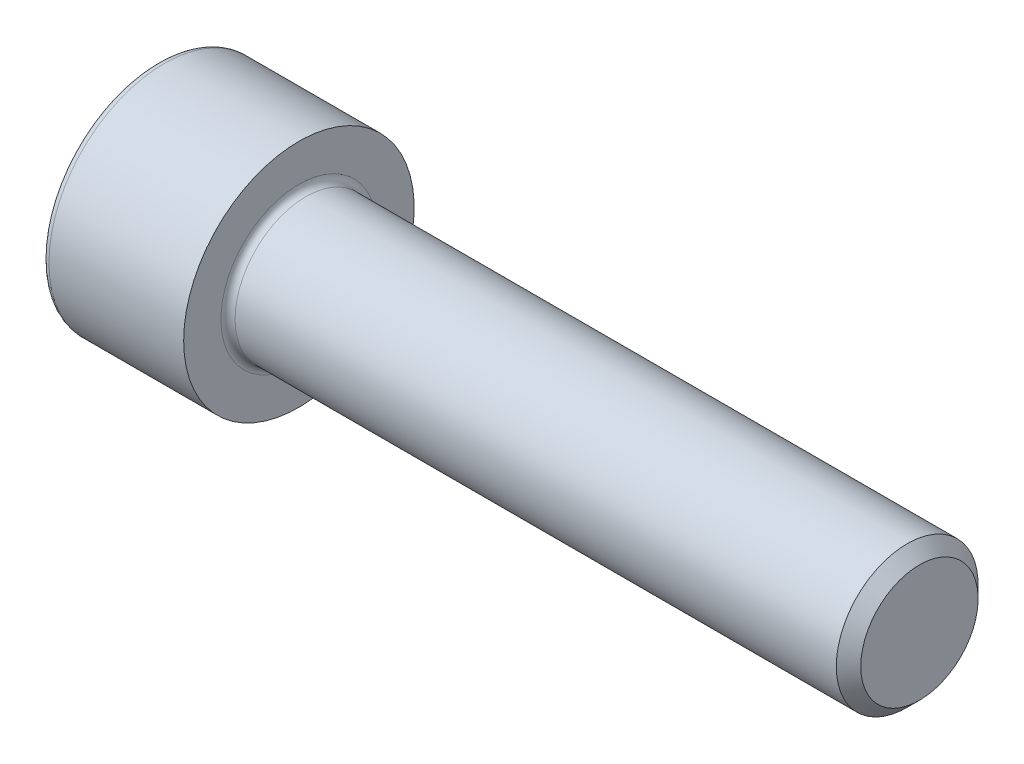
from build123d import *

# Parameters (mm, degrees)
FILLET1_R   = 0.4
FILLET2_R   = 0.4
HEX_2_DEPTH = 4


with BuildPart() as part:
    # BodySke → Base-Revolve (revolve)
    with BuildSketch(Plane.XY, mode=Mode.PRIVATE) as base_revolve_sk:
        Polygon((0, 0), (0, 6.5), (8, 6.5), (8, 4), (42.3095, 4), (43, 3.3095), (43, 0), align=None)
    revolve(base_revolve_sk.sketch.rotate(Axis((-31.75, 0, 0), (1, 0, 0)), 90), axis=Axis((-31.75, 0, 0), (1, 0, 0)))

    # Fillet1
    fillet1_edges = [part.edges().sort_by_distance(p)[0] for p in [
        (8, 0, -4),
    ]]
    fillet(fillet1_edges, radius=FILLET1_R)

    # Fillet2
    fillet2_edges = [part.edges().sort_by_distance(p)[0] for p in [
        (0, 0, -6.5),
    ]]
    fillet(fillet2_edges, radius=FILLET2_R)

    # Sketch2 → Hex-PreBroach (revolve, cut)
    with BuildSketch(Plane.XY, mode=Mode.PRIVATE) as hex_prebroach_sk:
        Polygon((0, 3.0475), (4, 3.0475), (5.759474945, 0), (0, 0), align=None)
    revolve(hex_prebroach_sk.sketch.rotate(Axis((0, 0, 0), (1, 0, 0)), 90), axis=Axis((0, 0, 0), (1, 0, 0)), mode=Mode.SUBTRACT)

    # Sketch3 → Hex 2 (cut)
    with BuildSketch(Plane(origin=(0, 0, 0), x_dir=(0, 0.500000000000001, 0.866025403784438), z_dir=(-1, 0, 0))):
        Polygon((1.759474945, 3.0475), (-1.759474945, 3.0475), (-3.518949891, 0), (-1.759474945, -3.0475), (1.759474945, -3.0475), (3.518949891, 0), align=None)
    extrude(amount=-HEX_2_DEPTH, mode=Mode.SUBTRACT)


solid = part.part
